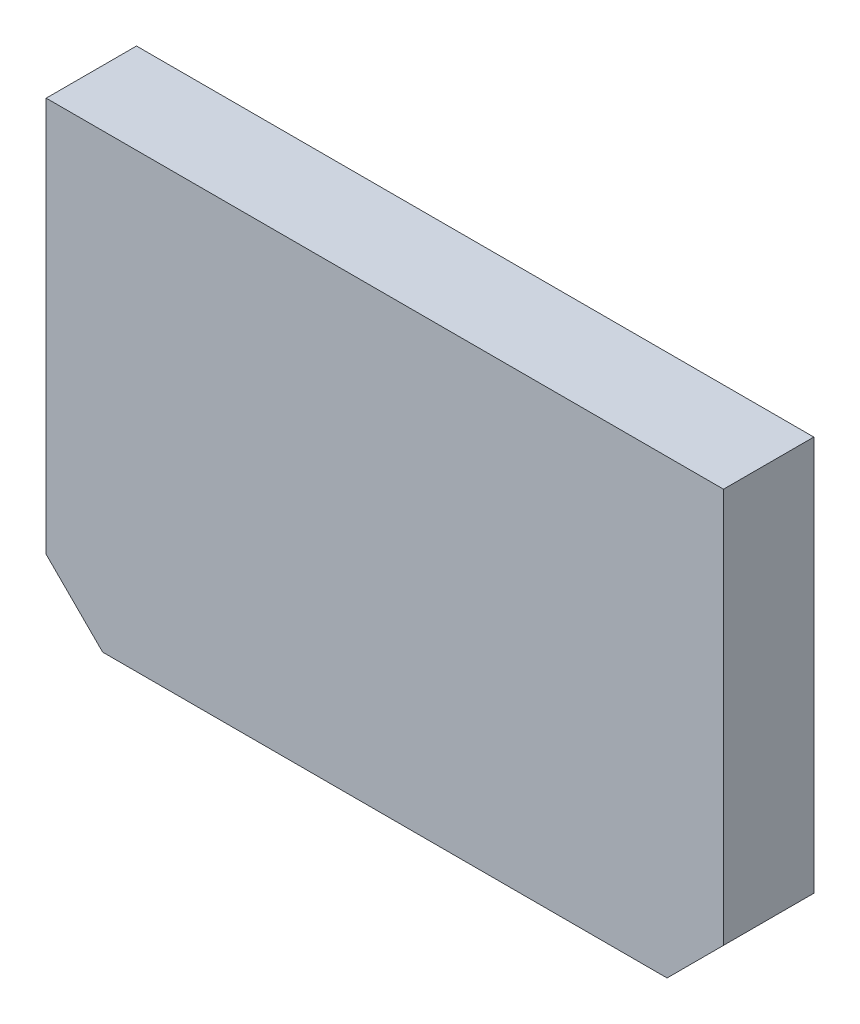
ISO-10303-21;
HEADER;
FILE_DESCRIPTION(('STEP AP214'),'2;1');
FILE_NAME('part.step','',(''),(''),'','','');
FILE_SCHEMA(('AUTOMOTIVE_DESIGN { 1 0 10303 214 1 1 1 1 }'));
ENDSEC;
DATA;
#1=APPLICATION_CONTEXT('core data for automotive mechanical design processes');
#2=APPLICATION_PROTOCOL_DEFINITION('international standard','automotive_design',2000,#1);
#3=PRODUCT_CONTEXT('',#1,'mechanical');
#4=PRODUCT('Part','Part','',(#3));
#5=PRODUCT_RELATED_PRODUCT_CATEGORY('part','',(#4));
#6=PRODUCT_DEFINITION_FORMATION('','',#4);
#7=PRODUCT_DEFINITION_CONTEXT('part definition',#1,'design');
#8=PRODUCT_DEFINITION('design','',#6,#7);
#9=PRODUCT_DEFINITION_SHAPE('','',#8);
#10=(LENGTH_UNIT() NAMED_UNIT(*) SI_UNIT(.MILLI.,.METRE.));
#11=(NAMED_UNIT(*) PLANE_ANGLE_UNIT() SI_UNIT($,.RADIAN.));
#12=(NAMED_UNIT(*) SI_UNIT($,.STERADIAN.) SOLID_ANGLE_UNIT());
#13=UNCERTAINTY_MEASURE_WITH_UNIT(LENGTH_MEASURE(1.E-05),#10,'distance_accuracy_value','');
#14=(GEOMETRIC_REPRESENTATION_CONTEXT(3) GLOBAL_UNCERTAINTY_ASSIGNED_CONTEXT((#13)) GLOBAL_UNIT_ASSIGNED_CONTEXT((#10,
#11,#12)) REPRESENTATION_CONTEXT('',''));
#15=CARTESIAN_POINT('',(0.,0.,0.));
#16=DIRECTION('',(0.,0.,1.));
#17=DIRECTION('',(1.,0.,0.));
#18=AXIS2_PLACEMENT_3D('',#15,#16,#17);
#19=CARTESIAN_POINT('',(0.,0.,8.00000000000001));
#20=DIRECTION('',(1.,0.,0.));
#21=DIRECTION('',(0.,0.,-1.));
#22=AXIS2_PLACEMENT_3D('',#19,#20,#21);
#23=PLANE('',#22);
#24=DIRECTION('',(0.,-1.,0.));
#25=VECTOR('',#24,1.);
#26=CARTESIAN_POINT('',(0.,0.,0.));
#27=LINE('',#26,#25);
#28=CARTESIAN_POINT('',(0.,40.,0.));
#29=VERTEX_POINT('',#28);
#30=CARTESIAN_POINT('',(0.,5.,0.));
#31=VERTEX_POINT('',#30);
#32=EDGE_CURVE('E118',#29,#31,#27,.T.);
#33=ORIENTED_EDGE('',*,*,#32,.T.);
#34=DIRECTION('',(0.,0.,1.));
#35=VECTOR('',#34,1.);
#36=CARTESIAN_POINT('',(0.,5.,8.00000000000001));
#37=LINE('',#36,#35);
#38=CARTESIAN_POINT('',(0.,5.,8.00000000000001));
#39=VERTEX_POINT('',#38);
#40=EDGE_CURVE('E63',#31,#39,#37,.T.);
#41=ORIENTED_EDGE('',*,*,#40,.T.);
#42=DIRECTION('',(0.,-1.,0.));
#43=VECTOR('',#42,1.);
#44=CARTESIAN_POINT('',(0.,0.,8.00000000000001));
#45=LINE('',#44,#43);
#46=CARTESIAN_POINT('',(0.,40.,8.00000000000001));
#47=VERTEX_POINT('',#46);
#48=EDGE_CURVE('E119',#47,#39,#45,.T.);
#49=ORIENTED_EDGE('',*,*,#48,.F.);
#50=DIRECTION('',(0.,0.,-1.));
#51=VECTOR('',#50,1.);
#52=CARTESIAN_POINT('',(0.,40.,8.00000000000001));
#53=LINE('',#52,#51);
#54=EDGE_CURVE('E113',#47,#29,#53,.T.);
#55=ORIENTED_EDGE('',*,*,#54,.T.);
#56=EDGE_LOOP('',(#33,#41,#49,#55));
#57=FACE_BOUND('',#56,.T.);
#58=ADVANCED_FACE('F41',(#57),#23,.F.);
#59=CARTESIAN_POINT('',(0.,0.,8.00000000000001));
#60=DIRECTION('',(0.,1.,0.));
#61=DIRECTION('',(0.,0.,1.));
#62=AXIS2_PLACEMENT_3D('',#59,#60,#61);
#63=PLANE('',#62);
#64=DIRECTION('',(1.,0.,0.));
#65=VECTOR('',#64,1.);
#66=CARTESIAN_POINT('',(0.,0.,8.00000000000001));
#67=LINE('',#66,#65);
#68=CARTESIAN_POINT('',(5.,0.,8.00000000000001));
#69=VERTEX_POINT('',#68);
#70=CARTESIAN_POINT('',(55.,0.,8.00000000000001));
#71=VERTEX_POINT('',#70);
#72=EDGE_CURVE('E121',#69,#71,#67,.T.);
#73=ORIENTED_EDGE('',*,*,#72,.F.);
#74=DIRECTION('',(0.,0.,-1.));
#75=VECTOR('',#74,1.);
#76=CARTESIAN_POINT('',(5.,0.,8.00000000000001));
#77=LINE('',#76,#75);
#78=CARTESIAN_POINT('',(5.,0.,0.));
#79=VERTEX_POINT('',#78);
#80=EDGE_CURVE('E131',#69,#79,#77,.T.);
#81=ORIENTED_EDGE('',*,*,#80,.T.);
#82=DIRECTION('',(1.,0.,0.));
#83=VECTOR('',#82,1.);
#84=CARTESIAN_POINT('',(0.,0.,0.));
#85=LINE('',#84,#83);
#86=CARTESIAN_POINT('',(55.,0.,0.));
#87=VERTEX_POINT('',#86);
#88=EDGE_CURVE('E105',#79,#87,#85,.T.);
#89=ORIENTED_EDGE('',*,*,#88,.T.);
#90=DIRECTION('',(0.,0.,1.));
#91=VECTOR('',#90,1.);
#92=CARTESIAN_POINT('',(55.,0.,8.00000000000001));
#93=LINE('',#92,#91);
#94=EDGE_CURVE('E112',#87,#71,#93,.T.);
#95=ORIENTED_EDGE('',*,*,#94,.T.);
#96=EDGE_LOOP('',(#73,#81,#89,#95));
#97=FACE_BOUND('',#96,.T.);
#98=ADVANCED_FACE('F145',(#97),#63,.F.);
#99=CARTESIAN_POINT('',(60.,0.,8.00000000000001));
#100=DIRECTION('',(-1.,0.,0.));
#101=DIRECTION('',(0.,0.,1.));
#102=AXIS2_PLACEMENT_3D('',#99,#100,#101);
#103=PLANE('',#102);
#104=DIRECTION('',(0.,1.,0.));
#105=VECTOR('',#104,1.);
#106=CARTESIAN_POINT('',(60.,0.,8.00000000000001));
#107=LINE('',#106,#105);
#108=CARTESIAN_POINT('',(60.,5.,8.00000000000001));
#109=VERTEX_POINT('',#108);
#110=CARTESIAN_POINT('',(60.,40.0000000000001,8.00000000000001));
#111=VERTEX_POINT('',#110);
#112=EDGE_CURVE('E126',#109,#111,#107,.T.);
#113=ORIENTED_EDGE('',*,*,#112,.F.);
#114=DIRECTION('',(0.,0.,-1.));
#115=VECTOR('',#114,1.);
#116=CARTESIAN_POINT('',(60.,5.,8.00000000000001));
#117=LINE('',#116,#115);
#118=CARTESIAN_POINT('',(60.,5.,0.));
#119=VERTEX_POINT('',#118);
#120=EDGE_CURVE('E11',#109,#119,#117,.T.);
#121=ORIENTED_EDGE('',*,*,#120,.T.);
#122=DIRECTION('',(0.,1.,0.));
#123=VECTOR('',#122,1.);
#124=CARTESIAN_POINT('',(60.,0.,0.));
#125=LINE('',#124,#123);
#126=CARTESIAN_POINT('',(60.,40.0000000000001,0.));
#127=VERTEX_POINT('',#126);
#128=EDGE_CURVE('E96',#119,#127,#125,.T.);
#129=ORIENTED_EDGE('',*,*,#128,.T.);
#130=DIRECTION('',(0.,0.,-1.));
#131=VECTOR('',#130,1.);
#132=CARTESIAN_POINT('',(60.,40.0000000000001,8.00000000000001));
#133=LINE('',#132,#131);
#134=EDGE_CURVE('E99',#111,#127,#133,.T.);
#135=ORIENTED_EDGE('',*,*,#134,.F.);
#136=EDGE_LOOP('',(#113,#121,#129,#135));
#137=FACE_BOUND('',#136,.T.);
#138=ADVANCED_FACE('F98',(#137),#103,.F.);
#139=CARTESIAN_POINT('',(0.,40.,8.00000000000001));
#140=DIRECTION('',(0.,-1.,0.));
#141=DIRECTION('',(0.,0.,-1.));
#142=AXIS2_PLACEMENT_3D('',#139,#140,#141);
#143=PLANE('',#142);
#144=DIRECTION('',(-1.,0.,0.));
#145=VECTOR('',#144,1.);
#146=CARTESIAN_POINT('',(0.,40.,0.));
#147=LINE('',#146,#145);
#148=EDGE_CURVE('E104',#127,#29,#147,.T.);
#149=ORIENTED_EDGE('',*,*,#148,.T.);
#150=ORIENTED_EDGE('',*,*,#54,.F.);
#151=DIRECTION('',(-1.,0.,0.));
#152=VECTOR('',#151,1.);
#153=CARTESIAN_POINT('',(0.,40.,8.00000000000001));
#154=LINE('',#153,#152);
#155=EDGE_CURVE('E111',#111,#47,#154,.T.);
#156=ORIENTED_EDGE('',*,*,#155,.F.);
#157=ORIENTED_EDGE('',*,*,#134,.T.);
#158=EDGE_LOOP('',(#149,#150,#156,#157));
#159=FACE_BOUND('',#158,.T.);
#160=ADVANCED_FACE('F108',(#159),#143,.F.);
#161=CARTESIAN_POINT('',(0.,40.,8.00000000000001));
#162=DIRECTION('',(0.,0.,-1.));
#163=DIRECTION('',(-1.,0.,0.));
#164=AXIS2_PLACEMENT_3D('',#161,#162,#163);
#165=PLANE('',#164);
#166=ORIENTED_EDGE('',*,*,#48,.T.);
#167=DIRECTION('',(-0.707106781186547,0.707106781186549,0.));
#168=VECTOR('',#167,1.);
#169=CARTESIAN_POINT('',(5.,0.,8.00000000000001));
#170=LINE('',#169,#168);
#171=EDGE_CURVE('E48',#39,#69,#170,.F.);
#172=ORIENTED_EDGE('',*,*,#171,.T.);
#173=ORIENTED_EDGE('',*,*,#72,.T.);
#174=DIRECTION('',(-0.707106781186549,-0.707106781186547,0.));
#175=VECTOR('',#174,1.);
#176=CARTESIAN_POINT('',(60.,5.,8.00000000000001));
#177=LINE('',#176,#175);
#178=EDGE_CURVE('E55',#71,#109,#177,.F.);
#179=ORIENTED_EDGE('',*,*,#178,.T.);
#180=ORIENTED_EDGE('',*,*,#112,.T.);
#181=ORIENTED_EDGE('',*,*,#155,.T.);
#182=EDGE_LOOP('',(#166,#172,#173,#179,#180,#181));
#183=FACE_BOUND('',#182,.T.);
#184=ADVANCED_FACE('F141',(#183),#165,.F.);
#185=CARTESIAN_POINT('',(0.,40.,0.));
#186=DIRECTION('',(0.,0.,-1.));
#187=DIRECTION('',(-1.,0.,0.));
#188=AXIS2_PLACEMENT_3D('',#185,#186,#187);
#189=PLANE('',#188);
#190=ORIENTED_EDGE('',*,*,#88,.F.);
#191=DIRECTION('',(0.707106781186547,-0.707106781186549,0.));
#192=VECTOR('',#191,1.);
#193=CARTESIAN_POINT('',(-17.5,22.5000000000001,0.));
#194=LINE('',#193,#192);
#195=EDGE_CURVE('E136',#79,#31,#194,.F.);
#196=ORIENTED_EDGE('',*,*,#195,.T.);
#197=ORIENTED_EDGE('',*,*,#32,.F.);
#198=ORIENTED_EDGE('',*,*,#148,.F.);
#199=ORIENTED_EDGE('',*,*,#128,.F.);
#200=DIRECTION('',(0.707106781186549,0.707106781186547,0.));
#201=VECTOR('',#200,1.);
#202=CARTESIAN_POINT('',(47.4999999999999,-7.50000000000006,0.));
#203=LINE('',#202,#201);
#204=EDGE_CURVE('E134',#119,#87,#203,.F.);
#205=ORIENTED_EDGE('',*,*,#204,.T.);
#206=EDGE_LOOP('',(#190,#196,#197,#198,#199,#205));
#207=FACE_BOUND('',#206,.T.);
#208=ADVANCED_FACE('F117',(#207),#189,.T.);
#209=CARTESIAN_POINT('',(5.,0.,8.00000000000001));
#210=DIRECTION('',(0.707106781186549,0.707106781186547,0.));
#211=DIRECTION('',(-0.707106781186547,0.707106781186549,0.));
#212=AXIS2_PLACEMENT_3D('',#209,#210,#211);
#213=PLANE('',#212);
#214=ORIENTED_EDGE('',*,*,#171,.F.);
#215=ORIENTED_EDGE('',*,*,#40,.F.);
#216=ORIENTED_EDGE('',*,*,#195,.F.);
#217=ORIENTED_EDGE('',*,*,#80,.F.);
#218=EDGE_LOOP('',(#214,#215,#216,#217));
#219=FACE_BOUND('',#218,.T.);
#220=ADVANCED_FACE('F148',(#219),#213,.F.);
#221=CARTESIAN_POINT('',(60.,5.,8.00000000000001));
#222=DIRECTION('',(-0.707106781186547,0.707106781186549,0.));
#223=DIRECTION('',(-0.707106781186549,-0.707106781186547,0.));
#224=AXIS2_PLACEMENT_3D('',#221,#222,#223);
#225=PLANE('',#224);
#226=ORIENTED_EDGE('',*,*,#178,.F.);
#227=ORIENTED_EDGE('',*,*,#94,.F.);
#228=ORIENTED_EDGE('',*,*,#204,.F.);
#229=ORIENTED_EDGE('',*,*,#120,.F.);
#230=EDGE_LOOP('',(#226,#227,#228,#229));
#231=FACE_BOUND('',#230,.T.);
#232=ADVANCED_FACE('F151',(#231),#225,.F.);
#233=CLOSED_SHELL('',(#58,#98,#138,#160,#184,#208,#220,#232));
#234=MANIFOLD_SOLID_BREP('B2',#233);
#235=ADVANCED_BREP_SHAPE_REPRESENTATION('',(#18,#234),#14);
#236=SHAPE_DEFINITION_REPRESENTATION(#9,#235);
ENDSEC;
END-ISO-10303-21;
